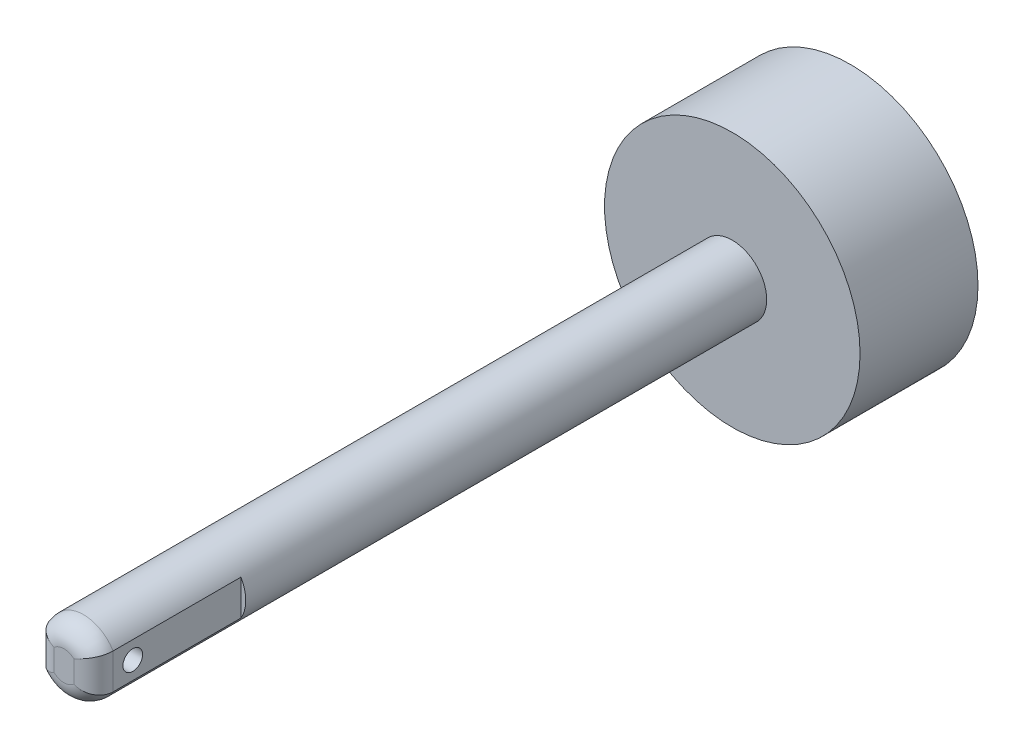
ISO-10303-21;
HEADER;
FILE_DESCRIPTION(('STEP AP214'),'2;1');
FILE_NAME('part.step','',(''),(''),'','','');
FILE_SCHEMA(('AUTOMOTIVE_DESIGN { 1 0 10303 214 1 1 1 1 }'));
ENDSEC;
DATA;
#1=APPLICATION_CONTEXT('core data for automotive mechanical design processes');
#2=APPLICATION_PROTOCOL_DEFINITION('international standard','automotive_design',2000,#1);
#3=PRODUCT_CONTEXT('',#1,'mechanical');
#4=PRODUCT('Part','Part','',(#3));
#5=PRODUCT_RELATED_PRODUCT_CATEGORY('part','',(#4));
#6=PRODUCT_DEFINITION_FORMATION('','',#4);
#7=PRODUCT_DEFINITION_CONTEXT('part definition',#1,'design');
#8=PRODUCT_DEFINITION('design','',#6,#7);
#9=PRODUCT_DEFINITION_SHAPE('','',#8);
#10=(LENGTH_UNIT() NAMED_UNIT(*) SI_UNIT(.MILLI.,.METRE.));
#11=(NAMED_UNIT(*) PLANE_ANGLE_UNIT() SI_UNIT($,.RADIAN.));
#12=(NAMED_UNIT(*) SI_UNIT($,.STERADIAN.) SOLID_ANGLE_UNIT());
#13=UNCERTAINTY_MEASURE_WITH_UNIT(LENGTH_MEASURE(1.E-05),#10,'distance_accuracy_value','');
#14=(GEOMETRIC_REPRESENTATION_CONTEXT(3) GLOBAL_UNCERTAINTY_ASSIGNED_CONTEXT((#13)) GLOBAL_UNIT_ASSIGNED_CONTEXT((#10,
#11,#12)) REPRESENTATION_CONTEXT('',''));
#15=CARTESIAN_POINT('',(0.,0.,0.));
#16=DIRECTION('',(0.,0.,1.));
#17=DIRECTION('',(1.,0.,0.));
#18=AXIS2_PLACEMENT_3D('',#15,#16,#17);
#19=CARTESIAN_POINT('',(0.,0.,12.));
#20=DIRECTION('',(0.,0.,1.));
#21=DIRECTION('',(1.,0.,0.));
#22=AXIS2_PLACEMENT_3D('',#19,#20,#21);
#23=PLANE('',#22);
#24=CARTESIAN_POINT('',(0.,0.,12.));
#25=DIRECTION('',(0.,0.,1.));
#26=DIRECTION('',(1.,0.,0.));
#27=AXIS2_PLACEMENT_3D('',#24,#25,#26);
#28=CIRCLE('',#27,13.);
#29=CARTESIAN_POINT('',(13.,0.,12.));
#30=VERTEX_POINT('',#29);
#31=EDGE_CURVE('E124',#30,#30,#28,.T.);
#32=ORIENTED_EDGE('',*,*,#31,.T.);
#33=EDGE_LOOP('',(#32));
#34=FACE_BOUND('',#33,.T.);
#35=CARTESIAN_POINT('',(0.,0.,12.));
#36=DIRECTION('',(0.,0.,1.));
#37=DIRECTION('',(1.,0.,0.));
#38=AXIS2_PLACEMENT_3D('',#35,#36,#37);
#39=CIRCLE('',#38,3.5);
#40=CARTESIAN_POINT('',(3.5,0.,12.));
#41=VERTEX_POINT('',#40);
#42=EDGE_CURVE('E118',#41,#41,#39,.T.);
#43=ORIENTED_EDGE('',*,*,#42,.F.);
#44=EDGE_LOOP('',(#43));
#45=FACE_BOUND('',#44,.T.);
#46=ADVANCED_FACE('F28',(#34,#45),#23,.T.);
#47=CARTESIAN_POINT('',(0.,0.,12.));
#48=DIRECTION('',(0.,0.,-1.));
#49=DIRECTION('',(-1.,0.,0.));
#50=AXIS2_PLACEMENT_3D('',#47,#48,#49);
#51=CYLINDRICAL_SURFACE('',#50,13.);
#52=ORIENTED_EDGE('',*,*,#31,.F.);
#53=EDGE_LOOP('',(#52));
#54=FACE_BOUND('',#53,.T.);
#55=CARTESIAN_POINT('',(0.,0.,0.));
#56=DIRECTION('',(0.,0.,1.));
#57=DIRECTION('',(1.,0.,0.));
#58=AXIS2_PLACEMENT_3D('',#55,#56,#57);
#59=CIRCLE('',#58,13.);
#60=CARTESIAN_POINT('',(13.,0.,0.));
#61=VERTEX_POINT('',#60);
#62=EDGE_CURVE('E121',#61,#61,#59,.T.);
#63=ORIENTED_EDGE('',*,*,#62,.T.);
#64=EDGE_LOOP('',(#63));
#65=FACE_BOUND('',#64,.T.);
#66=ADVANCED_FACE('F30',(#54,#65),#51,.T.);
#67=CARTESIAN_POINT('',(0.,0.,0.));
#68=DIRECTION('',(0.,0.,1.));
#69=DIRECTION('',(1.,0.,0.));
#70=AXIS2_PLACEMENT_3D('',#67,#68,#69);
#71=PLANE('',#70);
#72=ORIENTED_EDGE('',*,*,#62,.F.);
#73=EDGE_LOOP('',(#72));
#74=FACE_BOUND('',#73,.T.);
#75=ADVANCED_FACE('F200',(#74),#71,.F.);
#76=CARTESIAN_POINT('',(0.,0.,80.));
#77=DIRECTION('',(0.,0.,-1.));
#78=DIRECTION('',(-1.,0.,0.));
#79=AXIS2_PLACEMENT_3D('',#76,#77,#78);
#80=CYLINDRICAL_SURFACE('',#79,3.5);
#81=DIRECTION('',(0.,0.,-1.));
#82=VECTOR('',#81,1.);
#83=CARTESIAN_POINT('',(-3.,1.802775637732,80.));
#84=LINE('',#83,#82);
#85=CARTESIAN_POINT('',(-3.,1.802775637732,65.));
#86=VERTEX_POINT('',#85);
#87=CARTESIAN_POINT('',(-3.,1.80277563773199,78.));
#88=VERTEX_POINT('',#87);
#89=EDGE_CURVE('E93',#86,#88,#84,.F.);
#90=ORIENTED_EDGE('',*,*,#89,.T.);
#91=CARTESIAN_POINT('',(0.,0.,78.));
#92=DIRECTION('',(0.,0.,1.));
#93=DIRECTION('',(1.,0.,0.));
#94=AXIS2_PLACEMENT_3D('',#91,#92,#93);
#95=CIRCLE('',#94,3.5);
#96=CARTESIAN_POINT('',(3.,1.80277563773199,78.0000000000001));
#97=VERTEX_POINT('',#96);
#98=EDGE_CURVE('E138',#88,#97,#95,.F.);
#99=ORIENTED_EDGE('',*,*,#98,.T.);
#100=DIRECTION('',(0.,0.,-1.));
#101=VECTOR('',#100,1.);
#102=CARTESIAN_POINT('',(3.,1.802775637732,80.));
#103=LINE('',#102,#101);
#104=CARTESIAN_POINT('',(3.,1.802775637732,65.));
#105=VERTEX_POINT('',#104);
#106=EDGE_CURVE('E116',#97,#105,#103,.T.);
#107=ORIENTED_EDGE('',*,*,#106,.T.);
#108=CARTESIAN_POINT('',(0.,0.,65.));
#109=DIRECTION('',(0.,0.,1.));
#110=DIRECTION('',(1.,0.,0.));
#111=AXIS2_PLACEMENT_3D('',#108,#109,#110);
#112=CIRCLE('',#111,3.5);
#113=CARTESIAN_POINT('',(3.,-1.802775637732,65.));
#114=VERTEX_POINT('',#113);
#115=EDGE_CURVE('E100',#114,#105,#112,.T.);
#116=ORIENTED_EDGE('',*,*,#115,.F.);
#117=DIRECTION('',(0.,0.,-1.));
#118=VECTOR('',#117,1.);
#119=CARTESIAN_POINT('',(3.,-1.80277563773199,80.));
#120=LINE('',#119,#118);
#121=CARTESIAN_POINT('',(3.,-1.80277563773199,78.));
#122=VERTEX_POINT('',#121);
#123=EDGE_CURVE('E114',#114,#122,#120,.F.);
#124=ORIENTED_EDGE('',*,*,#123,.T.);
#125=CARTESIAN_POINT('',(0.,0.,78.));
#126=DIRECTION('',(0.,0.,1.));
#127=DIRECTION('',(1.,0.,0.));
#128=AXIS2_PLACEMENT_3D('',#125,#126,#127);
#129=CIRCLE('',#128,3.5);
#130=CARTESIAN_POINT('',(-3.,-1.80277563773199,78.));
#131=VERTEX_POINT('',#130);
#132=EDGE_CURVE('E88',#122,#131,#129,.F.);
#133=ORIENTED_EDGE('',*,*,#132,.T.);
#134=DIRECTION('',(0.,0.,-1.));
#135=VECTOR('',#134,1.);
#136=CARTESIAN_POINT('',(-3.,-1.80277563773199,80.));
#137=LINE('',#136,#135);
#138=CARTESIAN_POINT('',(-3.,-1.802775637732,65.));
#139=VERTEX_POINT('',#138);
#140=EDGE_CURVE('E81',#131,#139,#137,.T.);
#141=ORIENTED_EDGE('',*,*,#140,.T.);
#142=CARTESIAN_POINT('',(0.,0.,65.));
#143=DIRECTION('',(0.,0.,-1.));
#144=DIRECTION('',(-1.,0.,0.));
#145=AXIS2_PLACEMENT_3D('',#142,#143,#144);
#146=CIRCLE('',#145,3.5);
#147=EDGE_CURVE('E86',#139,#86,#146,.T.);
#148=ORIENTED_EDGE('',*,*,#147,.T.);
#149=EDGE_LOOP('',(#90,#99,#107,#116,#124,#133,#141,#148));
#150=FACE_BOUND('',#149,.T.);
#151=ORIENTED_EDGE('',*,*,#42,.T.);
#152=EDGE_LOOP('',(#151));
#153=FACE_BOUND('',#152,.T.);
#154=ADVANCED_FACE('F84',(#150,#153),#80,.T.);
#155=CARTESIAN_POINT('',(0.,0.,80.));
#156=DIRECTION('',(0.,0.,1.));
#157=DIRECTION('',(1.,0.,0.));
#158=AXIS2_PLACEMENT_3D('',#155,#156,#157);
#159=PLANE('',#158);
#160=DIRECTION('',(0.,-1.,0.));
#161=VECTOR('',#160,1.);
#162=CARTESIAN_POINT('',(1.,1.802775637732,80.));
#163=LINE('',#162,#161);
#164=CARTESIAN_POINT('',(0.999999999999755,-1.11803398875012,80.));
#165=VERTEX_POINT('',#164);
#166=CARTESIAN_POINT('',(1.,1.11803398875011,80.));
#167=VERTEX_POINT('',#166);
#168=EDGE_CURVE('E132',#165,#167,#163,.F.);
#169=ORIENTED_EDGE('',*,*,#168,.T.);
#170=CARTESIAN_POINT('',(0.,0.,80.));
#171=DIRECTION('',(0.,0.,1.));
#172=DIRECTION('',(1.,0.,0.));
#173=AXIS2_PLACEMENT_3D('',#170,#171,#172);
#174=CIRCLE('',#173,1.5);
#175=CARTESIAN_POINT('',(-1.,1.11803398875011,80.));
#176=VERTEX_POINT('',#175);
#177=EDGE_CURVE('E134',#167,#176,#174,.T.);
#178=ORIENTED_EDGE('',*,*,#177,.T.);
#179=DIRECTION('',(0.,1.,0.));
#180=VECTOR('',#179,1.);
#181=CARTESIAN_POINT('',(-1.,-1.80277563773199,80.));
#182=LINE('',#181,#180);
#183=CARTESIAN_POINT('',(-1.,-1.11803398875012,80.));
#184=VERTEX_POINT('',#183);
#185=EDGE_CURVE('E99',#176,#184,#182,.F.);
#186=ORIENTED_EDGE('',*,*,#185,.T.);
#187=CARTESIAN_POINT('',(0.,0.,80.));
#188=DIRECTION('',(0.,0.,1.));
#189=DIRECTION('',(1.,0.,0.));
#190=AXIS2_PLACEMENT_3D('',#187,#188,#189);
#191=CIRCLE('',#190,1.5);
#192=EDGE_CURVE('E130',#184,#165,#191,.T.);
#193=ORIENTED_EDGE('',*,*,#192,.T.);
#194=EDGE_LOOP('',(#169,#178,#186,#193));
#195=FACE_BOUND('',#194,.T.);
#196=ADVANCED_FACE('F209',(#195),#159,.T.);
#197=CARTESIAN_POINT('',(3.,4.07703273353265,65.));
#198=DIRECTION('',(0.,0.,1.));
#199=DIRECTION('',(1.,0.,0.));
#200=AXIS2_PLACEMENT_3D('',#197,#198,#199);
#201=PLANE('',#200);
#202=ORIENTED_EDGE('',*,*,#115,.T.);
#203=DIRECTION('',(0.,-1.,0.));
#204=VECTOR('',#203,1.);
#205=CARTESIAN_POINT('',(3.,4.07703273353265,65.));
#206=LINE('',#205,#204);
#207=EDGE_CURVE('E92',#105,#114,#206,.T.);
#208=ORIENTED_EDGE('',*,*,#207,.T.);
#209=EDGE_LOOP('',(#202,#208));
#210=FACE_BOUND('',#209,.T.);
#211=ADVANCED_FACE('F145',(#210),#201,.T.);
#212=CARTESIAN_POINT('',(3.,4.07703273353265,65.));
#213=DIRECTION('',(-1.,0.,0.));
#214=DIRECTION('',(0.,-1.,0.));
#215=AXIS2_PLACEMENT_3D('',#212,#213,#214);
#216=PLANE('',#215);
#217=CARTESIAN_POINT('',(3.,0.,76.));
#218=DIRECTION('',(1.,0.,0.));
#219=DIRECTION('',(0.,1.,0.));
#220=AXIS2_PLACEMENT_3D('',#217,#218,#219);
#221=CIRCLE('',#220,0.999999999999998);
#222=CARTESIAN_POINT('',(3.,0.999999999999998,76.));
#223=VERTEX_POINT('',#222);
#224=EDGE_CURVE('E107',#223,#223,#221,.T.);
#225=ORIENTED_EDGE('',*,*,#224,.F.);
#226=EDGE_LOOP('',(#225));
#227=FACE_BOUND('',#226,.T.);
#228=ORIENTED_EDGE('',*,*,#106,.F.);
#229=DIRECTION('',(0.,-1.,0.));
#230=VECTOR('',#229,1.);
#231=CARTESIAN_POINT('',(3.,-1.80277563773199,78.));
#232=LINE('',#231,#230);
#233=EDGE_CURVE('E36',#97,#122,#232,.T.);
#234=ORIENTED_EDGE('',*,*,#233,.T.);
#235=ORIENTED_EDGE('',*,*,#123,.F.);
#236=ORIENTED_EDGE('',*,*,#207,.F.);
#237=EDGE_LOOP('',(#228,#234,#235,#236));
#238=FACE_BOUND('',#237,.T.);
#239=ADVANCED_FACE('F143',(#227,#238),#216,.F.);
#240=CARTESIAN_POINT('',(-3.,4.07703273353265,65.));
#241=DIRECTION('',(0.,0.,-1.));
#242=DIRECTION('',(-1.,0.,0.));
#243=AXIS2_PLACEMENT_3D('',#240,#241,#242);
#244=PLANE('',#243);
#245=DIRECTION('',(0.,1.,0.));
#246=VECTOR('',#245,1.);
#247=CARTESIAN_POINT('',(-3.,4.07703273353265,65.));
#248=LINE('',#247,#246);
#249=EDGE_CURVE('E98',#139,#86,#248,.T.);
#250=ORIENTED_EDGE('',*,*,#249,.T.);
#251=ORIENTED_EDGE('',*,*,#147,.F.);
#252=EDGE_LOOP('',(#250,#251));
#253=FACE_BOUND('',#252,.T.);
#254=ADVANCED_FACE('F97',(#253),#244,.F.);
#255=CARTESIAN_POINT('',(-3.,4.07703273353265,65.));
#256=DIRECTION('',(1.,0.,0.));
#257=DIRECTION('',(0.,1.,0.));
#258=AXIS2_PLACEMENT_3D('',#255,#256,#257);
#259=PLANE('',#258);
#260=CARTESIAN_POINT('',(-3.,0.,76.));
#261=DIRECTION('',(1.,0.,0.));
#262=DIRECTION('',(0.,1.,0.));
#263=AXIS2_PLACEMENT_3D('',#260,#261,#262);
#264=CIRCLE('',#263,0.999999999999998);
#265=CARTESIAN_POINT('',(-3.,0.999999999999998,76.));
#266=VERTEX_POINT('',#265);
#267=EDGE_CURVE('E103',#266,#266,#264,.T.);
#268=ORIENTED_EDGE('',*,*,#267,.T.);
#269=EDGE_LOOP('',(#268));
#270=FACE_BOUND('',#269,.T.);
#271=ORIENTED_EDGE('',*,*,#140,.F.);
#272=DIRECTION('',(0.,1.,0.));
#273=VECTOR('',#272,1.);
#274=CARTESIAN_POINT('',(-3.,1.80277563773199,78.));
#275=LINE('',#274,#273);
#276=EDGE_CURVE('E11',#131,#88,#275,.T.);
#277=ORIENTED_EDGE('',*,*,#276,.T.);
#278=ORIENTED_EDGE('',*,*,#89,.F.);
#279=ORIENTED_EDGE('',*,*,#249,.F.);
#280=EDGE_LOOP('',(#271,#277,#278,#279));
#281=FACE_BOUND('',#280,.T.);
#282=ADVANCED_FACE('F102',(#270,#281),#259,.F.);
#283=CARTESIAN_POINT('',(-13.,0.,76.));
#284=DIRECTION('',(1.,0.,0.));
#285=DIRECTION('',(0.,1.,0.));
#286=AXIS2_PLACEMENT_3D('',#283,#284,#285);
#287=CYLINDRICAL_SURFACE('',#286,0.999999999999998);
#288=ORIENTED_EDGE('',*,*,#224,.T.);
#289=EDGE_LOOP('',(#288));
#290=FACE_BOUND('',#289,.T.);
#291=ORIENTED_EDGE('',*,*,#267,.F.);
#292=EDGE_LOOP('',(#291));
#293=FACE_BOUND('',#292,.T.);
#294=ADVANCED_FACE('F220',(#290,#293),#287,.F.);
#295=CARTESIAN_POINT('',(0.,0.,78.));
#296=DIRECTION('',(0.,0.,1.));
#297=DIRECTION('',(1.,0.,0.));
#298=AXIS2_PLACEMENT_3D('',#295,#296,#297);
#299=DEGENERATE_TOROIDAL_SURFACE('',#298,1.5,2.,.T.);
#300=CARTESIAN_POINT('',(-3.,-1.80277563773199,78.));
#301=CARTESIAN_POINT('',(-3.00000063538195,-1.80277478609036,78.0546463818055));
#302=CARTESIAN_POINT('',(-2.99775882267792,-1.80215417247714,78.1092661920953));
#303=CARTESIAN_POINT('',(-2.98882206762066,-1.79967338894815,78.218106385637));
#304=CARTESIAN_POINT('',(-2.98212757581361,-1.79781334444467,78.2723268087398));
#305=CARTESIAN_POINT('',(-2.95545444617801,-1.79038563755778,78.4336298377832));
#306=CARTESIAN_POINT('',(-2.92888580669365,-1.78297038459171,78.5396176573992));
#307=CARTESIAN_POINT('',(-2.85907582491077,-1.76328443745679,78.7454296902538));
#308=CARTESIAN_POINT('',(-2.81583089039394,-1.75101269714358,78.8452525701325));
#309=CARTESIAN_POINT('',(-2.71413305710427,-1.72172799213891,79.0360646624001));
#310=CARTESIAN_POINT('',(-2.65568023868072,-1.70471505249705,79.1270539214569));
#311=CARTESIAN_POINT('',(-2.52470689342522,-1.66585972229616,79.2988767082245));
#312=CARTESIAN_POINT('',(-2.45202552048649,-1.64396167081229,79.3795748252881));
#313=CARTESIAN_POINT('',(-2.29541126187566,-1.5956175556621,79.5275872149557));
#314=CARTESIAN_POINT('',(-2.21147568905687,-1.56917040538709,79.5948982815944));
#315=CARTESIAN_POINT('',(-2.03215530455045,-1.51096966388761,79.7166167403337));
#316=CARTESIAN_POINT('',(-1.93648974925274,-1.47907315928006,79.7705413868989));
#317=CARTESIAN_POINT('',(-1.73900191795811,-1.41073364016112,79.8616380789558));
#318=CARTESIAN_POINT('',(-1.63717910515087,-1.37429022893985,79.8988086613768));
#319=CARTESIAN_POINT('',(-1.44731116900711,-1.30321224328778,79.9514090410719));
#320=CARTESIAN_POINT('',(-1.3597059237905,-1.26924086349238,79.9693851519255));
#321=CARTESIAN_POINT('',(-1.18427933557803,-1.19814044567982,79.9934522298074));
#322=CARTESIAN_POINT('',(-1.09645870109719,-1.16101741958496,79.9995653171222));
#323=CARTESIAN_POINT('',(-1.00630582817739,-1.12085136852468,79.9999925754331));
#324=CARTESIAN_POINT('',(-1.00315234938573,-1.11944375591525,80.0000000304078));
#325=CARTESIAN_POINT('',(-1.,-1.11803398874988,80.));
#326=B_SPLINE_CURVE_WITH_KNOTS('',3,(#300,#301,#302,#303,#304,#305,#306,#307,#308,#309,#310,
#311,#312,#313,#314,#315,#316,#317,#318,#319,#320,#321,#322,#323,#324,#325),.UNSPECIFIED.,.F.,
.F.,(4,2,2,2,2,2,2,2,2,2,2,2,4),(0.,0.163837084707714,0.32765759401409,0.654518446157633,
0.981449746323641,1.30837931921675,1.63924368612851,1.97018719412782,2.31173822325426,
2.6533190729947,2.9395704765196,3.22528760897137,3.23564771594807),.UNSPECIFIED.);
#327=EDGE_CURVE('E154',#131,#184,#326,.T.);
#328=ORIENTED_EDGE('',*,*,#327,.F.);
#329=ORIENTED_EDGE('',*,*,#132,.F.);
#330=CARTESIAN_POINT('',(3.,-1.80277563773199,78.));
#331=CARTESIAN_POINT('',(3.00000063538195,-1.80277478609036,78.0546463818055));
#332=CARTESIAN_POINT('',(2.99775882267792,-1.80215417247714,78.1092661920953));
#333=CARTESIAN_POINT('',(2.98882206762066,-1.79967338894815,78.218106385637));
#334=CARTESIAN_POINT('',(2.98212757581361,-1.79781334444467,78.2723268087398));
#335=CARTESIAN_POINT('',(2.95545444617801,-1.79038563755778,78.4336298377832));
#336=CARTESIAN_POINT('',(2.92888580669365,-1.78297038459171,78.5396176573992));
#337=CARTESIAN_POINT('',(2.85907582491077,-1.76328443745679,78.7454296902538));
#338=CARTESIAN_POINT('',(2.81583089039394,-1.75101269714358,78.8452525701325));
#339=CARTESIAN_POINT('',(2.71413305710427,-1.72172799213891,79.0360646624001));
#340=CARTESIAN_POINT('',(2.65568023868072,-1.70471505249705,79.1270539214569));
#341=CARTESIAN_POINT('',(2.52470689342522,-1.66585972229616,79.2988767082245));
#342=CARTESIAN_POINT('',(2.45202552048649,-1.64396167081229,79.3795748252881));
#343=CARTESIAN_POINT('',(2.29541126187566,-1.5956175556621,79.5275872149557));
#344=CARTESIAN_POINT('',(2.21147568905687,-1.56917040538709,79.5948982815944));
#345=CARTESIAN_POINT('',(2.03215530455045,-1.51096966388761,79.7166167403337));
#346=CARTESIAN_POINT('',(1.93648974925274,-1.47907315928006,79.7705413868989));
#347=CARTESIAN_POINT('',(1.73900191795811,-1.41073364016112,79.8616380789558));
#348=CARTESIAN_POINT('',(1.63717910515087,-1.37429022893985,79.8988086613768));
#349=CARTESIAN_POINT('',(1.44731116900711,-1.30321224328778,79.9514090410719));
#350=CARTESIAN_POINT('',(1.3597059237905,-1.26924086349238,79.9693851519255));
#351=CARTESIAN_POINT('',(1.18427933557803,-1.19814044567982,79.9934522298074));
#352=CARTESIAN_POINT('',(1.09645870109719,-1.16101741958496,79.9995653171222));
#353=CARTESIAN_POINT('',(1.00630582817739,-1.12085136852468,79.9999925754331));
#354=CARTESIAN_POINT('',(1.00315234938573,-1.11944375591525,80.0000000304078));
#355=CARTESIAN_POINT('',(1.,-1.11803398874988,80.));
#356=B_SPLINE_CURVE_WITH_KNOTS('',3,(#330,#331,#332,#333,#334,#335,#336,#337,#338,#339,#340,
#341,#342,#343,#344,#345,#346,#347,#348,#349,#350,#351,#352,#353,#354,#355),.UNSPECIFIED.,.F.,
.F.,(4,2,2,2,2,2,2,2,2,2,2,2,4),(0.,0.163837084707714,0.32765759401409,0.654518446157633,
0.981449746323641,1.30837931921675,1.63924368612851,1.97018719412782,2.31173822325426,
2.6533190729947,2.9395704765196,3.22528760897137,3.23564771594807),.UNSPECIFIED.);
#357=EDGE_CURVE('E151',#165,#122,#356,.F.);
#358=ORIENTED_EDGE('',*,*,#357,.F.);
#359=ORIENTED_EDGE('',*,*,#192,.F.);
#360=EDGE_LOOP('',(#328,#329,#358,#359));
#361=FACE_BOUND('',#360,.T.);
#362=ADVANCED_FACE('F149',(#361),#299,.T.);
#363=CARTESIAN_POINT('',(1.,4.07703273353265,78.));
#364=DIRECTION('',(0.,1.,0.));
#365=DIRECTION('',(-1.,0.,0.));
#366=AXIS2_PLACEMENT_3D('',#363,#364,#365);
#367=CYLINDRICAL_SURFACE('',#366,2.);
#368=ORIENTED_EDGE('',*,*,#357,.T.);
#369=ORIENTED_EDGE('',*,*,#233,.F.);
#370=CARTESIAN_POINT('',(3.,1.80277563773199,78.0000000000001));
#371=CARTESIAN_POINT('',(3.00000063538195,1.80277478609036,78.0546463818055));
#372=CARTESIAN_POINT('',(2.99775882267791,1.80215417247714,78.1092661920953));
#373=CARTESIAN_POINT('',(2.98882206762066,1.79967338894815,78.218106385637));
#374=CARTESIAN_POINT('',(2.98212757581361,1.79781334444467,78.2723268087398));
#375=CARTESIAN_POINT('',(2.955454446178,1.79038563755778,78.4336298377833));
#376=CARTESIAN_POINT('',(2.92888580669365,1.78297038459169,78.5396176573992));
#377=CARTESIAN_POINT('',(2.85907582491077,1.76328443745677,78.7454296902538));
#378=CARTESIAN_POINT('',(2.81583089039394,1.75101269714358,78.8452525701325));
#379=CARTESIAN_POINT('',(2.71413305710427,1.72172799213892,79.0360646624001));
#380=CARTESIAN_POINT('',(2.65568023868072,1.70471505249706,79.1270539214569));
#381=CARTESIAN_POINT('',(2.52470689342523,1.66585972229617,79.2988767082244));
#382=CARTESIAN_POINT('',(2.45202552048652,1.6439616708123,79.3795748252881));
#383=CARTESIAN_POINT('',(2.29541126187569,1.59561755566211,79.5275872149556));
#384=CARTESIAN_POINT('',(2.21147568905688,1.56917040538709,79.5948982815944));
#385=CARTESIAN_POINT('',(2.03215530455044,1.51096966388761,79.7166167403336));
#386=CARTESIAN_POINT('',(1.93648974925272,1.47907315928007,79.7705413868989));
#387=CARTESIAN_POINT('',(1.7390019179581,1.41073364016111,79.8616380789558));
#388=CARTESIAN_POINT('',(1.63717910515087,1.37429022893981,79.8988086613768));
#389=CARTESIAN_POINT('',(1.44731116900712,1.30321224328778,79.9514090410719));
#390=CARTESIAN_POINT('',(1.3597059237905,1.26924086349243,79.9693851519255));
#391=CARTESIAN_POINT('',(1.18427933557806,1.1981404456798,79.9934522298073));
#392=CARTESIAN_POINT('',(1.09645870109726,1.16101741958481,79.9995653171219));
#393=CARTESIAN_POINT('',(1.00630582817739,1.12085136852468,79.999992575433));
#394=CARTESIAN_POINT('',(1.00315234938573,1.11944375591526,80.0000000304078));
#395=CARTESIAN_POINT('',(1.,1.11803398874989,80.));
#396=B_SPLINE_CURVE_WITH_KNOTS('',3,(#370,#371,#372,#373,#374,#375,#376,#377,#378,#379,#380,
#381,#382,#383,#384,#385,#386,#387,#388,#389,#390,#391,#392,#393,#394,#395),.UNSPECIFIED.,.F.,
.F.,(4,2,2,2,2,2,2,2,2,2,2,2,4),(0.,0.163837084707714,0.327657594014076,0.654518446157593,
0.981449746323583,1.30837931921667,1.63924368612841,1.97018719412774,2.31173822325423,
2.65331907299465,2.93957047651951,3.22528760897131,3.23564771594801),.UNSPECIFIED.);
#397=EDGE_CURVE('E50',#167,#97,#396,.F.);
#398=ORIENTED_EDGE('',*,*,#397,.F.);
#399=ORIENTED_EDGE('',*,*,#168,.F.);
#400=EDGE_LOOP('',(#368,#369,#398,#399));
#401=FACE_BOUND('',#400,.T.);
#402=ADVANCED_FACE('F157',(#401),#367,.T.);
#403=CARTESIAN_POINT('',(-1.,4.07703273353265,78.));
#404=DIRECTION('',(0.,-1.,0.));
#405=DIRECTION('',(1.,0.,0.));
#406=AXIS2_PLACEMENT_3D('',#403,#404,#405);
#407=CYLINDRICAL_SURFACE('',#406,2.);
#408=ORIENTED_EDGE('',*,*,#327,.T.);
#409=ORIENTED_EDGE('',*,*,#185,.F.);
#410=CARTESIAN_POINT('',(-3.,1.80277563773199,78.0000000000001));
#411=CARTESIAN_POINT('',(-3.00000063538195,1.80277478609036,78.0546463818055));
#412=CARTESIAN_POINT('',(-2.99775882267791,1.80215417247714,78.1092661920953));
#413=CARTESIAN_POINT('',(-2.98882206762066,1.79967338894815,78.218106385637));
#414=CARTESIAN_POINT('',(-2.98212757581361,1.79781334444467,78.2723268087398));
#415=CARTESIAN_POINT('',(-2.955454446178,1.79038563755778,78.4336298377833));
#416=CARTESIAN_POINT('',(-2.92888580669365,1.78297038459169,78.5396176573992));
#417=CARTESIAN_POINT('',(-2.85907582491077,1.76328443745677,78.7454296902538));
#418=CARTESIAN_POINT('',(-2.81583089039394,1.75101269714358,78.8452525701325));
#419=CARTESIAN_POINT('',(-2.71413305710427,1.72172799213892,79.0360646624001));
#420=CARTESIAN_POINT('',(-2.65568023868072,1.70471505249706,79.1270539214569));
#421=CARTESIAN_POINT('',(-2.52470689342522,1.66585972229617,79.2988767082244));
#422=CARTESIAN_POINT('',(-2.45202552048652,1.6439616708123,79.3795748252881));
#423=CARTESIAN_POINT('',(-2.29541126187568,1.59561755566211,79.5275872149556));
#424=CARTESIAN_POINT('',(-2.21147568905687,1.56917040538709,79.5948982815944));
#425=CARTESIAN_POINT('',(-2.03215530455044,1.51096966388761,79.7166167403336));
#426=CARTESIAN_POINT('',(-1.93648974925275,1.47907315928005,79.7705413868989));
#427=CARTESIAN_POINT('',(-1.7390019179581,1.41073364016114,79.8616380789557));
#428=CARTESIAN_POINT('',(-1.63717910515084,1.3742902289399,79.8988086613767));
#429=CARTESIAN_POINT('',(-1.44731116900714,1.3032122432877,79.9514090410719));
#430=CARTESIAN_POINT('',(-1.3597059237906,1.26924086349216,79.9693851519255));
#431=CARTESIAN_POINT('',(-1.18427933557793,1.19814044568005,79.9934522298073));
#432=CARTESIAN_POINT('',(-1.09645870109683,1.16101741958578,79.9995653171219));
#433=CARTESIAN_POINT('',(-1.00630582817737,1.12085136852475,79.999992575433));
#434=CARTESIAN_POINT('',(-1.00315234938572,1.1194437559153,80.0000000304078));
#435=CARTESIAN_POINT('',(-1.,1.11803398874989,80.));
#436=B_SPLINE_CURVE_WITH_KNOTS('',3,(#410,#411,#412,#413,#414,#415,#416,#417,#418,#419,#420,
#421,#422,#423,#424,#425,#426,#427,#428,#429,#430,#431,#432,#433,#434,#435),.UNSPECIFIED.,.F.,
.F.,(4,2,2,2,2,2,2,2,2,2,2,2,4),(0.,0.163837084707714,0.327657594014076,0.654518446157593,
0.981449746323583,1.30837931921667,1.63924368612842,1.97018719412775,2.31173822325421,
2.65331907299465,2.93957047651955,3.22528760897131,3.23564771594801),.UNSPECIFIED.);
#437=EDGE_CURVE('E182',#88,#176,#436,.T.);
#438=ORIENTED_EDGE('',*,*,#437,.F.);
#439=ORIENTED_EDGE('',*,*,#276,.F.);
#440=EDGE_LOOP('',(#408,#409,#438,#439));
#441=FACE_BOUND('',#440,.T.);
#442=ADVANCED_FACE('F174',(#441),#407,.T.);
#443=CARTESIAN_POINT('',(0.,0.,78.));
#444=DIRECTION('',(0.,0.,1.));
#445=DIRECTION('',(1.,0.,0.));
#446=AXIS2_PLACEMENT_3D('',#443,#444,#445);
#447=DEGENERATE_TOROIDAL_SURFACE('',#446,1.5,2.,.T.);
#448=ORIENTED_EDGE('',*,*,#397,.T.);
#449=ORIENTED_EDGE('',*,*,#98,.F.);
#450=ORIENTED_EDGE('',*,*,#437,.T.);
#451=ORIENTED_EDGE('',*,*,#177,.F.);
#452=EDGE_LOOP('',(#448,#449,#450,#451));
#453=FACE_BOUND('',#452,.T.);
#454=ADVANCED_FACE('F186',(#453),#447,.T.);
#455=CLOSED_SHELL('',(#46,#66,#75,#154,#196,#211,#239,#254,#282,#294,#362,#402,#442,#454));
#456=MANIFOLD_SOLID_BREP('B2',#455);
#457=ADVANCED_BREP_SHAPE_REPRESENTATION('',(#18,#456),#14);
#458=SHAPE_DEFINITION_REPRESENTATION(#9,#457);
ENDSEC;
END-ISO-10303-21;
